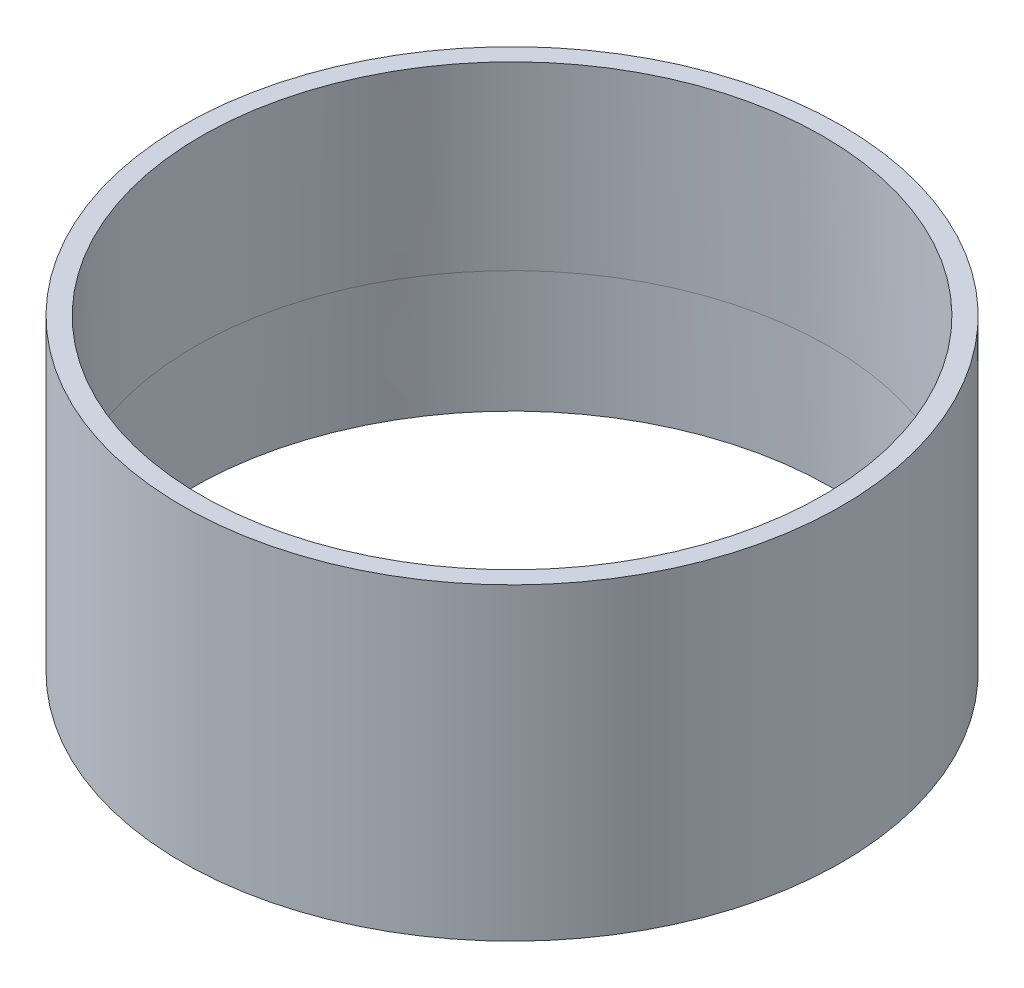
from build123d import *


with BuildPart() as part:
    # Szkic1 → Obr_t1 (revolve)
    with BuildSketch(Plane.XY, mode=Mode.PRIVATE) as obr_t1_sk:
        Polygon((25.2, 60), (25.7, 44.9979998), (25.9, 35), (26.7, 35), (26.7, 60), align=None)
    revolve(obr_t1_sk.sketch.rotate(Axis((0, 0, 0), (0, 1, 0)), 90), axis=Axis((0, 0, 0), (0, 1, 0)))


solid = part.part
